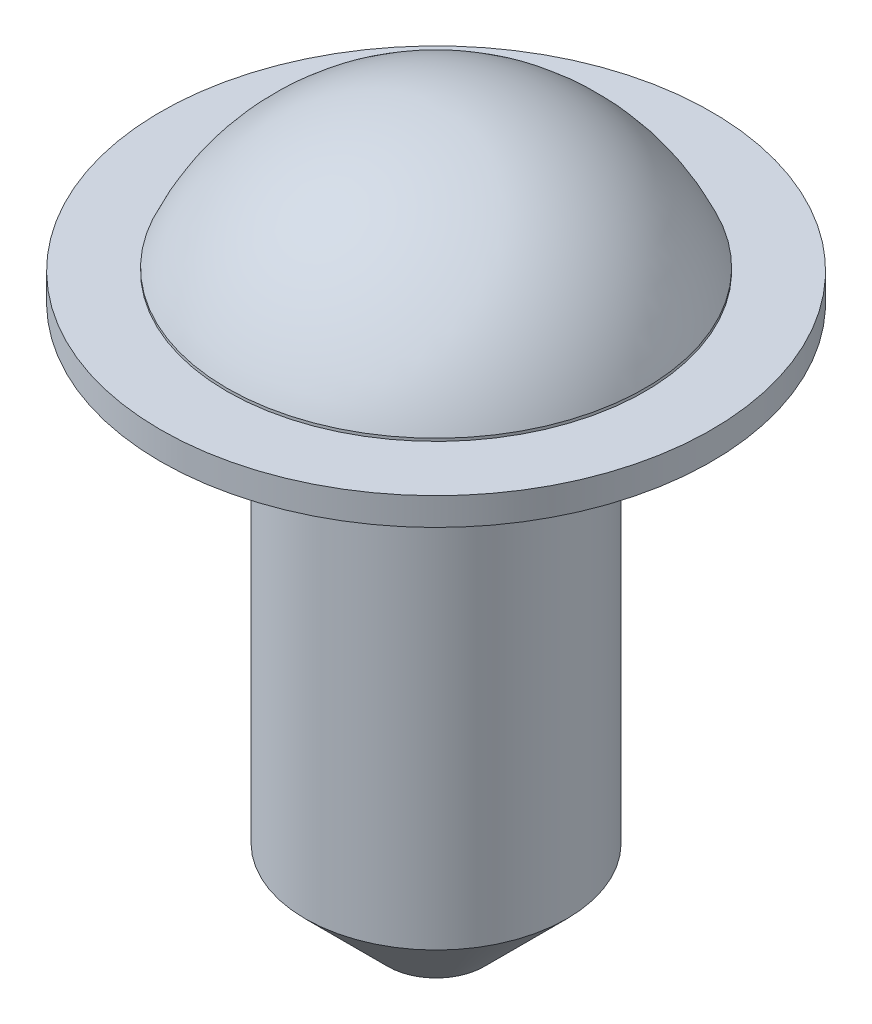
ISO-10303-21;
HEADER;
FILE_DESCRIPTION(('STEP AP214'),'2;1');
FILE_NAME('part.step','',(''),(''),'','','');
FILE_SCHEMA(('AUTOMOTIVE_DESIGN { 1 0 10303 214 1 1 1 1 }'));
ENDSEC;
DATA;
#1=APPLICATION_CONTEXT('core data for automotive mechanical design processes');
#2=APPLICATION_PROTOCOL_DEFINITION('international standard','automotive_design',2000,#1);
#3=PRODUCT_CONTEXT('',#1,'mechanical');
#4=PRODUCT('Part','Part','',(#3));
#5=PRODUCT_RELATED_PRODUCT_CATEGORY('part','',(#4));
#6=PRODUCT_DEFINITION_FORMATION('','',#4);
#7=PRODUCT_DEFINITION_CONTEXT('part definition',#1,'design');
#8=PRODUCT_DEFINITION('design','',#6,#7);
#9=PRODUCT_DEFINITION_SHAPE('','',#8);
#10=(LENGTH_UNIT() NAMED_UNIT(*) SI_UNIT(.MILLI.,.METRE.));
#11=(NAMED_UNIT(*) PLANE_ANGLE_UNIT() SI_UNIT($,.RADIAN.));
#12=(NAMED_UNIT(*) SI_UNIT($,.STERADIAN.) SOLID_ANGLE_UNIT());
#13=UNCERTAINTY_MEASURE_WITH_UNIT(LENGTH_MEASURE(1.E-05),#10,'distance_accuracy_value','');
#14=(GEOMETRIC_REPRESENTATION_CONTEXT(3) GLOBAL_UNCERTAINTY_ASSIGNED_CONTEXT((#13)) GLOBAL_UNIT_ASSIGNED_CONTEXT((#10,
#11,#12)) REPRESENTATION_CONTEXT('',''));
#15=CARTESIAN_POINT('',(0.,0.,0.));
#16=DIRECTION('',(0.,0.,1.));
#17=DIRECTION('',(1.,0.,0.));
#18=AXIS2_PLACEMENT_3D('',#15,#16,#17);
#19=CARTESIAN_POINT('',(0.,4.,0.));
#20=DIRECTION('',(0.,-1.,0.));
#21=DIRECTION('',(0.,0.,-1.));
#22=AXIS2_PLACEMENT_3D('',#19,#20,#21);
#23=CYLINDRICAL_SURFACE('',#22,0.95);
#24=CARTESIAN_POINT('',(0.,0.599999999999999,0.));
#25=DIRECTION('',(0.,1.,0.));
#26=DIRECTION('',(0.,0.,1.));
#27=AXIS2_PLACEMENT_3D('',#24,#25,#26);
#28=CIRCLE('',#27,0.95);
#29=CARTESIAN_POINT('',(0.,0.599999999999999,0.95));
#30=VERTEX_POINT('',#29);
#31=EDGE_CURVE('E41',#30,#30,#28,.T.);
#32=ORIENTED_EDGE('',*,*,#31,.T.);
#33=EDGE_LOOP('',(#32));
#34=FACE_BOUND('',#33,.T.);
#35=CARTESIAN_POINT('',(0.,4.,0.));
#36=DIRECTION('',(0.,1.,0.));
#37=DIRECTION('',(0.,0.,1.));
#38=AXIS2_PLACEMENT_3D('',#35,#36,#37);
#39=CIRCLE('',#38,0.95);
#40=CARTESIAN_POINT('',(0.,4.,0.95));
#41=VERTEX_POINT('',#40);
#42=EDGE_CURVE('E49',#41,#41,#39,.T.);
#43=ORIENTED_EDGE('',*,*,#42,.F.);
#44=EDGE_LOOP('',(#43));
#45=FACE_BOUND('',#44,.T.);
#46=ADVANCED_FACE('F33',(#34,#45),#23,.T.);
#47=CARTESIAN_POINT('',(0.,0.,0.));
#48=DIRECTION('',(0.,1.,0.));
#49=DIRECTION('',(0.,0.,1.));
#50=AXIS2_PLACEMENT_3D('',#47,#48,#49);
#51=PLANE('',#50);
#52=CARTESIAN_POINT('',(0.,0.,0.));
#53=DIRECTION('',(0.,1.,0.));
#54=DIRECTION('',(0.,0.,1.));
#55=AXIS2_PLACEMENT_3D('',#52,#53,#54);
#56=CIRCLE('',#55,0.35);
#57=CARTESIAN_POINT('',(0.,0.,0.35));
#58=VERTEX_POINT('',#57);
#59=EDGE_CURVE('E10',#58,#58,#56,.F.);
#60=ORIENTED_EDGE('',*,*,#59,.T.);
#61=EDGE_LOOP('',(#60));
#62=FACE_BOUND('',#61,.T.);
#63=ADVANCED_FACE('F69',(#62),#51,.F.);
#64=CARTESIAN_POINT('',(0.,4.2,0.));
#65=DIRECTION('',(0.,-1.,0.));
#66=DIRECTION('',(0.,0.,-1.));
#67=AXIS2_PLACEMENT_3D('',#64,#65,#66);
#68=CYLINDRICAL_SURFACE('',#67,2.);
#69=CARTESIAN_POINT('',(0.,4.2,0.));
#70=DIRECTION('',(0.,1.,0.));
#71=DIRECTION('',(0.,0.,1.));
#72=AXIS2_PLACEMENT_3D('',#69,#70,#71);
#73=CIRCLE('',#72,2.);
#74=CARTESIAN_POINT('',(0.,4.2,2.));
#75=VERTEX_POINT('',#74);
#76=EDGE_CURVE('E58',#75,#75,#73,.T.);
#77=ORIENTED_EDGE('',*,*,#76,.F.);
#78=EDGE_LOOP('',(#77));
#79=FACE_BOUND('',#78,.T.);
#80=CARTESIAN_POINT('',(0.,4.,0.));
#81=DIRECTION('',(0.,1.,0.));
#82=DIRECTION('',(0.,0.,1.));
#83=AXIS2_PLACEMENT_3D('',#80,#81,#82);
#84=CIRCLE('',#83,2.);
#85=CARTESIAN_POINT('',(0.,4.,2.));
#86=VERTEX_POINT('',#85);
#87=EDGE_CURVE('E55',#86,#86,#84,.T.);
#88=ORIENTED_EDGE('',*,*,#87,.T.);
#89=EDGE_LOOP('',(#88));
#90=FACE_BOUND('',#89,.T.);
#91=ADVANCED_FACE('F66',(#79,#90),#68,.T.);
#92=CARTESIAN_POINT('',(0.,4.2,0.));
#93=DIRECTION('',(0.,1.,0.));
#94=DIRECTION('',(0.,0.,1.));
#95=AXIS2_PLACEMENT_3D('',#92,#93,#94);
#96=PLANE('',#95);
#97=CARTESIAN_POINT('',(0.,4.2,0.));
#98=DIRECTION('',(0.,1.,0.));
#99=DIRECTION('',(0.,0.,1.));
#100=AXIS2_PLACEMENT_3D('',#97,#98,#99);
#101=CIRCLE('',#100,1.51762969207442);
#102=CARTESIAN_POINT('',(0.,4.2,-1.51762969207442));
#103=VERTEX_POINT('',#102);
#104=EDGE_CURVE('E45',#103,#103,#101,.T.);
#105=ORIENTED_EDGE('',*,*,#104,.F.);
#106=EDGE_LOOP('',(#105));
#107=FACE_BOUND('',#106,.T.);
#108=ORIENTED_EDGE('',*,*,#76,.T.);
#109=EDGE_LOOP('',(#108));
#110=FACE_BOUND('',#109,.T.);
#111=ADVANCED_FACE('F64',(#107,#110),#96,.T.);
#112=CARTESIAN_POINT('',(0.,4.,0.));
#113=DIRECTION('',(0.,1.,0.));
#114=DIRECTION('',(0.,0.,1.));
#115=AXIS2_PLACEMENT_3D('',#112,#113,#114);
#116=PLANE('',#115);
#117=ORIENTED_EDGE('',*,*,#42,.T.);
#118=EDGE_LOOP('',(#117));
#119=FACE_BOUND('',#118,.T.);
#120=ORIENTED_EDGE('',*,*,#87,.F.);
#121=EDGE_LOOP('',(#120));
#122=FACE_BOUND('',#121,.T.);
#123=ADVANCED_FACE('F73',(#119,#122),#116,.F.);
#124=CARTESIAN_POINT('',(0.,4.22,0.));
#125=DIRECTION('',(0.,-1.,0.));
#126=DIRECTION('',(0.,0.,-1.));
#127=AXIS2_PLACEMENT_3D('',#124,#125,#126);
#128=CYLINDRICAL_SURFACE('',#127,1.51762969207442);
#129=CARTESIAN_POINT('',(0.,4.22,0.));
#130=DIRECTION('',(0.,1.,0.));
#131=DIRECTION('',(0.,0.,1.));
#132=AXIS2_PLACEMENT_3D('',#129,#130,#131);
#133=CIRCLE('',#132,1.51762969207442);
#134=CARTESIAN_POINT('',(0.,4.22,-1.51762969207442));
#135=VERTEX_POINT('',#134);
#136=EDGE_CURVE('E52',#135,#135,#133,.T.);
#137=CARTESIAN_POINT('',(0.,4.22,-1.51762969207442));
#138=CARTESIAN_POINT('',(0.,4.21979166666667,-1.51762969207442));
#139=CARTESIAN_POINT('',(0.,4.21958333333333,-1.51762969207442));
#140=CARTESIAN_POINT('',(0.,4.21916666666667,-1.51762969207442));
#141=CARTESIAN_POINT('',(0.,4.21895833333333,-1.51762969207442));
#142=CARTESIAN_POINT('',(0.,4.21854166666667,-1.51762969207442));
#143=CARTESIAN_POINT('',(0.,4.21833333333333,-1.51762969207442));
#144=CARTESIAN_POINT('',(0.,4.21791666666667,-1.51762969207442));
#145=CARTESIAN_POINT('',(0.,4.21770833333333,-1.51762969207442));
#146=CARTESIAN_POINT('',(0.,4.21729166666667,-1.51762969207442));
#147=CARTESIAN_POINT('',(0.,4.21708333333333,-1.51762969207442));
#148=CARTESIAN_POINT('',(0.,4.21666666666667,-1.51762969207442));
#149=CARTESIAN_POINT('',(0.,4.21645833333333,-1.51762969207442));
#150=CARTESIAN_POINT('',(0.,4.21604166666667,-1.51762969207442));
#151=CARTESIAN_POINT('',(0.,4.21583333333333,-1.51762969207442));
#152=CARTESIAN_POINT('',(0.,4.21541666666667,-1.51762969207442));
#153=CARTESIAN_POINT('',(0.,4.21520833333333,-1.51762969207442));
#154=CARTESIAN_POINT('',(0.,4.21479166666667,-1.51762969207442));
#155=CARTESIAN_POINT('',(0.,4.21458333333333,-1.51762969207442));
#156=CARTESIAN_POINT('',(0.,4.21416666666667,-1.51762969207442));
#157=CARTESIAN_POINT('',(0.,4.21395833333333,-1.51762969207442));
#158=CARTESIAN_POINT('',(0.,4.21354166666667,-1.51762969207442));
#159=CARTESIAN_POINT('',(0.,4.21333333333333,-1.51762969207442));
#160=CARTESIAN_POINT('',(0.,4.21291666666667,-1.51762969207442));
#161=CARTESIAN_POINT('',(0.,4.21270833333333,-1.51762969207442));
#162=CARTESIAN_POINT('',(0.,4.21229166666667,-1.51762969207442));
#163=CARTESIAN_POINT('',(0.,4.21208333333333,-1.51762969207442));
#164=CARTESIAN_POINT('',(0.,4.21166666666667,-1.51762969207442));
#165=CARTESIAN_POINT('',(0.,4.21145833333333,-1.51762969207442));
#166=CARTESIAN_POINT('',(0.,4.21104166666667,-1.51762969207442));
#167=CARTESIAN_POINT('',(0.,4.21083333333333,-1.51762969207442));
#168=CARTESIAN_POINT('',(0.,4.21041666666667,-1.51762969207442));
#169=CARTESIAN_POINT('',(0.,4.21020833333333,-1.51762969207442));
#170=CARTESIAN_POINT('',(0.,4.20979166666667,-1.51762969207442));
#171=CARTESIAN_POINT('',(0.,4.20958333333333,-1.51762969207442));
#172=CARTESIAN_POINT('',(0.,4.20916666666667,-1.51762969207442));
#173=CARTESIAN_POINT('',(0.,4.20895833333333,-1.51762969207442));
#174=CARTESIAN_POINT('',(0.,4.20854166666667,-1.51762969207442));
#175=CARTESIAN_POINT('',(0.,4.20833333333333,-1.51762969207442));
#176=CARTESIAN_POINT('',(0.,4.20791666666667,-1.51762969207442));
#177=CARTESIAN_POINT('',(0.,4.20770833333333,-1.51762969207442));
#178=CARTESIAN_POINT('',(0.,4.20729166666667,-1.51762969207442));
#179=CARTESIAN_POINT('',(0.,4.20708333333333,-1.51762969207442));
#180=CARTESIAN_POINT('',(0.,4.20666666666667,-1.51762969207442));
#181=CARTESIAN_POINT('',(0.,4.20645833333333,-1.51762969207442));
#182=CARTESIAN_POINT('',(0.,4.20604166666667,-1.51762969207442));
#183=CARTESIAN_POINT('',(0.,4.20583333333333,-1.51762969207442));
#184=CARTESIAN_POINT('',(0.,4.20541666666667,-1.51762969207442));
#185=CARTESIAN_POINT('',(0.,4.20520833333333,-1.51762969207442));
#186=CARTESIAN_POINT('',(0.,4.20479166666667,-1.51762969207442));
#187=CARTESIAN_POINT('',(0.,4.20458333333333,-1.51762969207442));
#188=CARTESIAN_POINT('',(0.,4.20416666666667,-1.51762969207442));
#189=CARTESIAN_POINT('',(0.,4.20395833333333,-1.51762969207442));
#190=CARTESIAN_POINT('',(0.,4.20354166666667,-1.51762969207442));
#191=CARTESIAN_POINT('',(0.,4.20333333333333,-1.51762969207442));
#192=CARTESIAN_POINT('',(0.,4.20291666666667,-1.51762969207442));
#193=CARTESIAN_POINT('',(0.,4.20270833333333,-1.51762969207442));
#194=CARTESIAN_POINT('',(0.,4.20229166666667,-1.51762969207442));
#195=CARTESIAN_POINT('',(0.,4.20208333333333,-1.51762969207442));
#196=CARTESIAN_POINT('',(0.,4.20166666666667,-1.51762969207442));
#197=CARTESIAN_POINT('',(0.,4.20145833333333,-1.51762969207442));
#198=CARTESIAN_POINT('',(0.,4.20104166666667,-1.51762969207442));
#199=CARTESIAN_POINT('',(0.,4.20083333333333,-1.51762969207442));
#200=CARTESIAN_POINT('',(0.,4.20041666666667,-1.51762969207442));
#201=CARTESIAN_POINT('',(0.,4.20020833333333,-1.51762969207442));
#202=CARTESIAN_POINT('',(0.,4.2,-1.51762969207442));
#203=B_SPLINE_CURVE_WITH_KNOTS('',3,(#137,#138,#139,#140,#141,#142,#143,#144,#145,#146,#147,
#148,#149,#150,#151,#152,#153,#154,#155,#156,#157,#158,#159,#160,#161,#162,#163,#164,#165,#166,
#167,#168,#169,#170,#171,#172,#173,#174,#175,#176,#177,#178,#179,#180,#181,#182,#183,#184,#185,
#186,#187,#188,#189,#190,#191,#192,#193,#194,#195,#196,#197,#198,#199,#200,#201,#202),
.UNSPECIFIED.,.F.,.F.,(4,2,2,2,2,2,2,2,2,2,2,2,2,2,2,2,2,2,2,2,2,2,2,2,2,2,2,2,2,2,2,2,4),(0.,
0.000624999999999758,0.00124999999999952,0.00187499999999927,0.0024999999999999,
0.00312499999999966,0.00374999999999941,0.00437499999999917,0.0049999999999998,
0.00562499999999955,0.00624999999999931,0.00687499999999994,0.00749999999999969,
0.00812499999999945,0.00874999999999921,0.00937499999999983,0.00999999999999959,
0.0106249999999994,0.01125,0.0118749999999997,0.0124999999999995,0.0131249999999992,
0.0137499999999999,0.0143749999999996,0.0149999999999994,0.015625,0.0162499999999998,
0.0168749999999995,0.0174999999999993,0.0181249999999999,0.0187499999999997,0.0193749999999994,
0.0199999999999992),.UNSPECIFIED.);
#204=EDGE_CURVE('BSEAM75',#135,#103,#203,.T.);
#205=ORIENTED_EDGE('',*,*,#136,.F.);
#206=ORIENTED_EDGE('',*,*,#104,.T.);
#207=ORIENTED_EDGE('',*,*,#204,.T.);
#208=ORIENTED_EDGE('',*,*,#204,.F.);
#209=EDGE_LOOP('',(#205,#207,#206,#208));
#210=FACE_BOUND('',#209,.T.);
#211=ADVANCED_FACE('F75',(#210),#128,.T.);
#212=CARTESIAN_POINT('',(0.,3.56840005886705,0.));
#213=DIRECTION('',(0.,0.,1.));
#214=DIRECTION('',(1.,0.,0.));
#215=AXIS2_PLACEMENT_3D('',#212,#213,#214);
#216=SPHERICAL_SURFACE('',#215,1.65159994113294);
#217=CARTESIAN_POINT('',(0.,3.56840005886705,0.));
#218=DIRECTION('',(0.,1.,0.));
#219=DIRECTION('',(0.,0.,1.));
#220=AXIS2_PLACEMENT_3D('',#217,#218,#219);
#221=SPHERICAL_SURFACE('',#220,1.65159994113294);
#222=ORIENTED_EDGE('',*,*,#136,.T.);
#223=EDGE_LOOP('',(#222));
#224=FACE_BOUND('',#223,.T.);
#225=ADVANCED_FACE('F82',(#224),#221,.T.);
#226=CARTESIAN_POINT('',(0.,0.599999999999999,0.));
#227=DIRECTION('',(0.,1.,0.));
#228=DIRECTION('',(0.,0.,1.));
#229=AXIS2_PLACEMENT_3D('',#226,#227,#228);
#230=CONICAL_SURFACE('',#229,0.95,0.78539816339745);
#231=ORIENTED_EDGE('',*,*,#59,.F.);
#232=EDGE_LOOP('',(#231));
#233=FACE_BOUND('',#232,.T.);
#234=ORIENTED_EDGE('',*,*,#31,.F.);
#235=EDGE_LOOP('',(#234));
#236=FACE_BOUND('',#235,.T.);
#237=ADVANCED_FACE('F36',(#233,#236),#230,.T.);
#238=CLOSED_SHELL('',(#46,#63,#91,#111,#123,#211,#225,#237));
#239=MANIFOLD_SOLID_BREP('B2',#238);
#240=ADVANCED_BREP_SHAPE_REPRESENTATION('',(#18,#239),#14);
#241=SHAPE_DEFINITION_REPRESENTATION(#9,#240);
ENDSEC;
END-ISO-10303-21;
